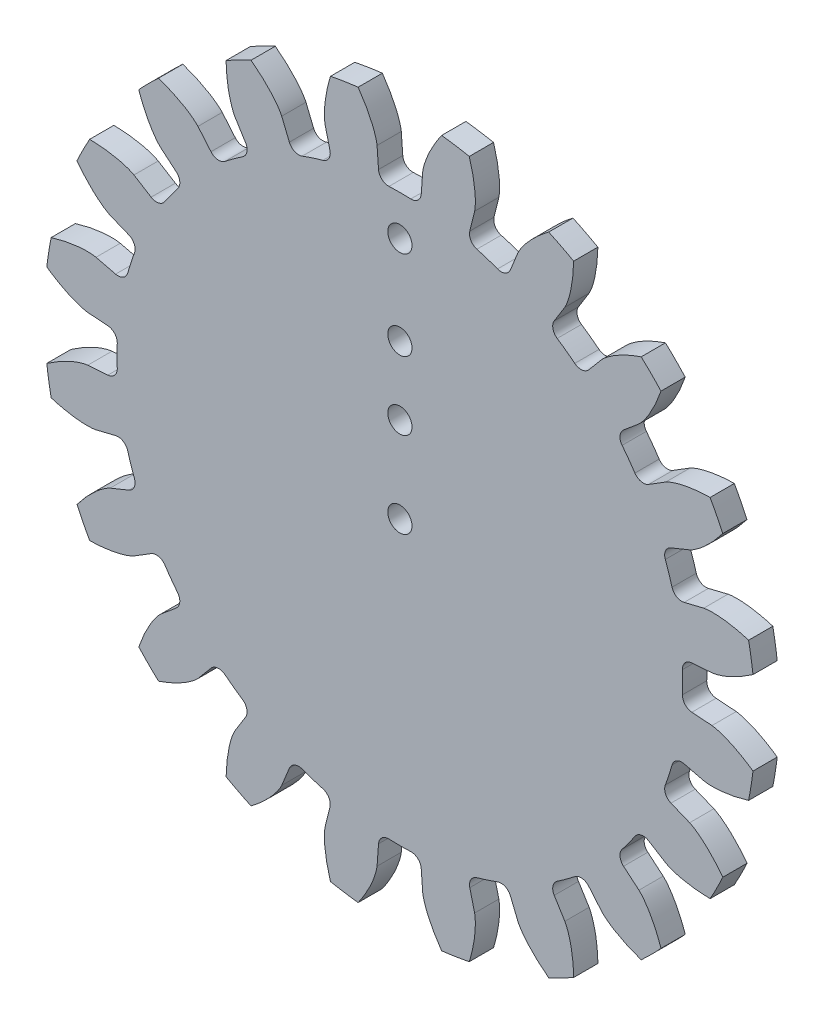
from build123d import *

# Parameters (mm, degrees)
BASECYLINDERSKETCH_R         = 46.566666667
BASECYLINDERSKETCH_R_2       = 1.5875
BASECYLINDER_DEPTH           = 3.175
TOOTH_DEPTH                  = 66.931703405
TOOTHGULLETFILLET_R          = 1.323318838
TEETH_COUNT                  = 20
TOOTHGULLETFILLET_OF_TEETH_R = 1.323318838
F_1_8_0_1250_DOWEL_HOLE1_D   = 3.175


with BuildPart() as part:
    # BaseCylinderSketch → BaseCylinder (new body)
    with BuildSketch(Plane.XY):
        Circle(BASECYLINDERSKETCH_R)
        Circle(BASECYLINDERSKETCH_R_2, mode=Mode.SUBTRACT)
    extrude(amount=BASECYLINDER_DEPTH)

    # InvoluteCurvesAndToothGulletSketch → Tooth (cut, symmetric)
    with BuildSketch(Plane.XY.offset(3.175)):
        with BuildLine():
            ThreePointArc((36.943026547, 2.701454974), (37.041666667, 0), (36.943026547, -2.701454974))
            Line((36.943026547, -2.701454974), (40.875775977, -2.989036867))
            add(Edge.make_bspline(
                [(40.875775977, -2.989036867), (40.884560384, -2.989780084), (40.909173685, -2.992175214), (40.955605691, -2.997929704), (41.031211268, -3.009060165), (41.127295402, -3.025799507), (41.251172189, -3.050369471), (41.396670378, -3.083084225), (41.556084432, -3.122983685), (41.72896144, -3.170647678), (41.90090875, -3.221958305), (42.071921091, -3.276637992), (42.241794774, -3.334256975), (42.446967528, -3.407769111), (42.692137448, -3.50108094), (42.977385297, -3.617657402), (43.299284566, -3.758723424), (43.625527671, -3.911935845), (43.945014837, -4.070448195), (44.265950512, -4.239491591), (44.575146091, -4.409345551), (44.894284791, -4.594844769), (45.187844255, -4.770686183), (45.514394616, -4.977700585), (45.777247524, -5.147687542), (46.046750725, -5.331606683), (46.177618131, -5.422348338), (46.244371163, -5.469239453)],
                knots=[0, 0, 0, 0, 0, 0.005376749, 0.015083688, 0.02853182, 0.04661014, 0.064854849, 0.092110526, 0.119476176, 0.146842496, 0.174208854, 0.201574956, 0.228941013, 0.256307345, 0.307035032, 0.361767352, 0.416499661, 0.471231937, 0.525964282, 0.580696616, 0.635428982, 0.690161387, 0.744893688, 0.799626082, 0.854358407, 0.909090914, 0.909090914, 0.909090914, 0.909090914, 0.909090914], degree=4))
            ThreePointArc((46.244371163, -5.469239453), (46.486022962, -2.73936373), (46.566666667, 0))
            ThreePointArc((46.566666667, 0), (46.486022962, 2.73936373), (46.244371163, 5.469239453))
            add(Edge.make_bspline(
                [(40.875775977, 2.989036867), (40.884560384, 2.989780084), (40.909173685, 2.992175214), (40.955605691, 2.997929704), (41.031211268, 3.009060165), (41.127295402, 3.025799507), (41.251172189, 3.050369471), (41.396670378, 3.083084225), (41.556084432, 3.122983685), (41.72896144, 3.170647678), (41.90090875, 3.221958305), (42.071921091, 3.276637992), (42.241794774, 3.334256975), (42.446967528, 3.407769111), (42.692137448, 3.50108094), (42.977385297, 3.617657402), (43.299284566, 3.758723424), (43.625527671, 3.911935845), (43.945014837, 4.070448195), (44.265950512, 4.239491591), (44.575146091, 4.409345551), (44.894284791, 4.594844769), (45.187844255, 4.770686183), (45.514394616, 4.977700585), (45.777247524, 5.147687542), (46.046750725, 5.331606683), (46.177618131, 5.422348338), (46.244371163, 5.469239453)],
                knots=[0, 0, 0, 0, 0, 0.005376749, 0.015083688, 0.02853182, 0.04661014, 0.064854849, 0.092110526, 0.119476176, 0.146842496, 0.174208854, 0.201574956, 0.228941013, 0.256307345, 0.307035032, 0.361767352, 0.416499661, 0.471231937, 0.525964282, 0.580696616, 0.635428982, 0.690161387, 0.744893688, 0.799626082, 0.854358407, 0.909090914, 0.909090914, 0.909090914, 0.909090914, 0.909090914], degree=4))
            Line((40.875775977, 2.989036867), (36.943026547, 2.701454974))
        make_face()
    tooth = extrude(amount=TOOTH_DEPTH, both=True, mode=Mode.SUBTRACT)

    # ToothGulletFillet
    toothgulletfillet_edges = [part.edges().sort_by_distance(p)[0] for p in [
        (36.943026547, 2.701454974, 1.5875),
        (36.943026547, -2.701454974, 1.5875),
    ]]
    fillet(toothgulletfillet_edges, radius=TOOTHGULLETFILLET_R)

    # Teeth: Tooth ×20 about axis
    teeth_axis = Axis((0, 0, 3.175), (0, 0, -1))
    for i in range(1, TEETH_COUNT):
        add(tooth.rotate(teeth_axis, i * 360 / TEETH_COUNT), mode=Mode.SUBTRACT)

    # ToothGulletFillet of Teeth
    toothgulletfillet_of_teeth_edges = [part.edges().sort_by_distance(p)[0] for p in [
        (35.969701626, -8.846786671, 1.5875),
        (34.300110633, -13.985259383, 1.5875),
        (31.475411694, -19.529043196, 1.5875),
        (28.299660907, -23.900089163, 1.5875),
        (23.900089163, -28.299660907, 1.5875),
        (19.529043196, -31.475411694, 1.5875),
        (13.985259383, -34.300110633, 1.5875),
        (8.846786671, -35.969701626, 1.5875),
        (2.701454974, -36.943026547, 1.5875),
        (-2.701454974, -36.943026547, 1.5875),
        (-8.846786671, -35.969701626, 1.5875),
        (-13.985259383, -34.300110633, 1.5875),
        (-19.529043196, -31.475411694, 1.5875),
        (-23.900089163, -28.299660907, 1.5875),
        (-28.299660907, -23.900089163, 1.5875),
        (-31.475411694, -19.529043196, 1.5875),
        (-34.300110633, -13.985259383, 1.5875),
        (-35.969701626, -8.846786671, 1.5875),
        (-36.943026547, -2.701454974, 1.5875),
        (-36.943026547, 2.701454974, 1.5875),
        (-35.969701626, 8.846786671, 1.5875),
        (-34.300110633, 13.985259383, 1.5875),
        (-31.475411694, 19.529043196, 1.5875),
        (-28.299660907, 23.900089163, 1.5875),
        (-23.900089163, 28.299660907, 1.5875),
        (-19.529043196, 31.475411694, 1.5875),
        (-13.985259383, 34.300110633, 1.5875),
        (-8.846786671, 35.969701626, 1.5875),
        (-2.701454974, 36.943026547, 1.5875),
        (2.701454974, 36.943026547, 1.5875),
        (8.846786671, 35.969701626, 1.5875),
        (13.985259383, 34.300110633, 1.5875),
        (19.529043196, 31.475411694, 1.5875),
        (23.900089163, 28.299660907, 1.5875),
        (28.299660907, 23.900089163, 1.5875),
        (31.475411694, 19.529043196, 1.5875),
        (34.300110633, 13.985259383, 1.5875),
        (35.969701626, 8.846786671, 1.5875),
    ]]
    fillet(toothgulletfillet_of_teeth_edges, radius=TOOTHGULLETFILLET_OF_TEETH_R)

    # 1_8 _0.1250_ Dowel Hole1 (through all)
    with Locations(Plane(origin=(0, 0, 0), x_dir=(-1, 0, 0), z_dir=(0, 0, -1))):
        with Locations((0, 11.221514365), (0, 20.179502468), (0, 31.81151687)):
            Hole(F_1_8_0_1250_DOWEL_HOLE1_D / 2)


solid = part.part
